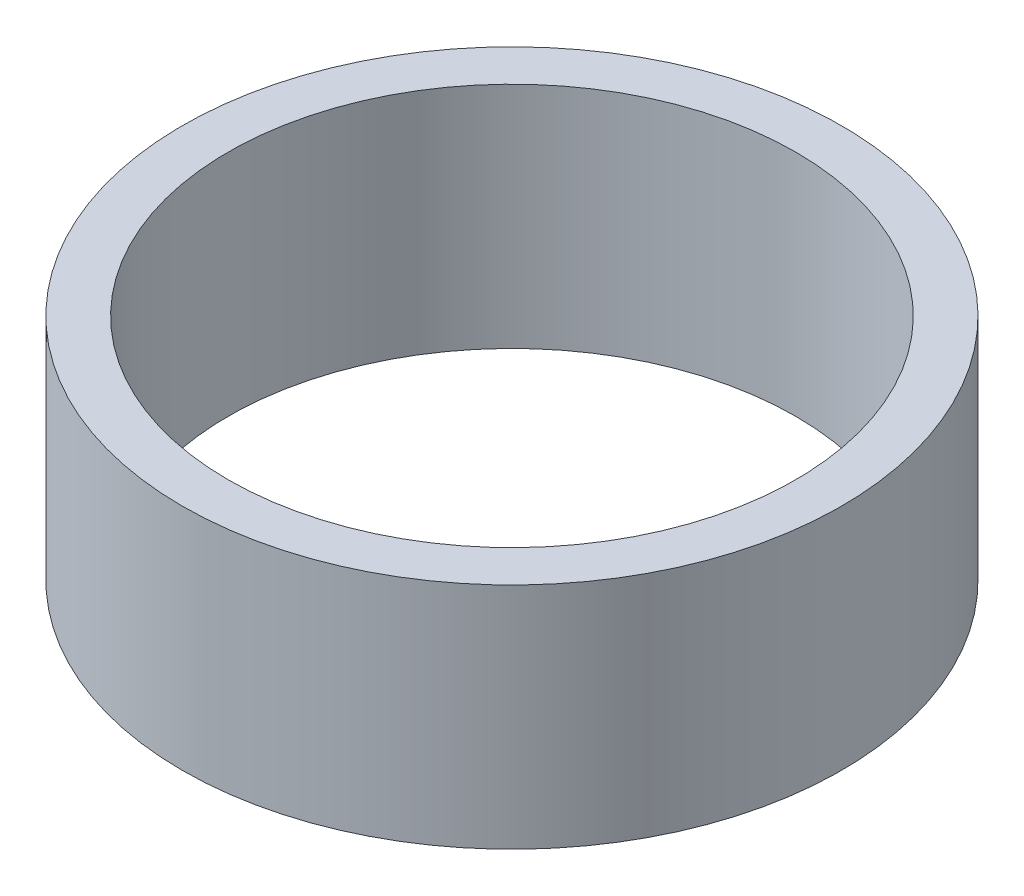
ISO-10303-21;
HEADER;
FILE_DESCRIPTION(('STEP AP214'),'2;1');
FILE_NAME('part.step','',(''),(''),'','','');
FILE_SCHEMA(('AUTOMOTIVE_DESIGN { 1 0 10303 214 1 1 1 1 }'));
ENDSEC;
DATA;
#1=APPLICATION_CONTEXT('core data for automotive mechanical design processes');
#2=APPLICATION_PROTOCOL_DEFINITION('international standard','automotive_design',2000,#1);
#3=PRODUCT_CONTEXT('',#1,'mechanical');
#4=PRODUCT('Part','Part','',(#3));
#5=PRODUCT_RELATED_PRODUCT_CATEGORY('part','',(#4));
#6=PRODUCT_DEFINITION_FORMATION('','',#4);
#7=PRODUCT_DEFINITION_CONTEXT('part definition',#1,'design');
#8=PRODUCT_DEFINITION('design','',#6,#7);
#9=PRODUCT_DEFINITION_SHAPE('','',#8);
#10=(LENGTH_UNIT() NAMED_UNIT(*) SI_UNIT(.MILLI.,.METRE.));
#11=(NAMED_UNIT(*) PLANE_ANGLE_UNIT() SI_UNIT($,.RADIAN.));
#12=(NAMED_UNIT(*) SI_UNIT($,.STERADIAN.) SOLID_ANGLE_UNIT());
#13=UNCERTAINTY_MEASURE_WITH_UNIT(LENGTH_MEASURE(1.E-05),#10,'distance_accuracy_value','');
#14=(GEOMETRIC_REPRESENTATION_CONTEXT(3) GLOBAL_UNCERTAINTY_ASSIGNED_CONTEXT((#13)) GLOBAL_UNIT_ASSIGNED_CONTEXT((#10,
#11,#12)) REPRESENTATION_CONTEXT('',''));
#15=CARTESIAN_POINT('',(0.,0.,0.));
#16=DIRECTION('',(0.,0.,1.));
#17=DIRECTION('',(1.,0.,0.));
#18=AXIS2_PLACEMENT_3D('',#15,#16,#17);
#19=CARTESIAN_POINT('',(0.,25.,0.));
#20=DIRECTION('',(0.,1.,0.));
#21=DIRECTION('',(0.,0.,1.));
#22=AXIS2_PLACEMENT_3D('',#19,#20,#21);
#23=PLANE('',#22);
#24=CARTESIAN_POINT('',(0.,25.,0.));
#25=DIRECTION('',(0.,1.,0.));
#26=DIRECTION('',(0.,0.,1.));
#27=AXIS2_PLACEMENT_3D('',#24,#25,#26);
#28=CIRCLE('',#27,36.);
#29=CARTESIAN_POINT('',(0.,25.,36.));
#30=VERTEX_POINT('',#29);
#31=EDGE_CURVE('E10',#30,#30,#28,.T.);
#32=ORIENTED_EDGE('',*,*,#31,.T.);
#33=EDGE_LOOP('',(#32));
#34=FACE_BOUND('',#33,.T.);
#35=CARTESIAN_POINT('',(0.,25.,0.));
#36=DIRECTION('',(0.,1.,0.));
#37=DIRECTION('',(0.,0.,1.));
#38=AXIS2_PLACEMENT_3D('',#35,#36,#37);
#39=CIRCLE('',#38,31.);
#40=CARTESIAN_POINT('',(0.,25.,31.));
#41=VERTEX_POINT('',#40);
#42=EDGE_CURVE('E43',#41,#41,#39,.T.);
#43=ORIENTED_EDGE('',*,*,#42,.F.);
#44=EDGE_LOOP('',(#43));
#45=FACE_BOUND('',#44,.T.);
#46=ADVANCED_FACE('F32',(#34,#45),#23,.T.);
#47=CARTESIAN_POINT('',(0.,0.,0.));
#48=DIRECTION('',(0.,1.,0.));
#49=DIRECTION('',(0.,0.,1.));
#50=AXIS2_PLACEMENT_3D('',#47,#48,#49);
#51=PLANE('',#50);
#52=CARTESIAN_POINT('',(0.,0.,0.));
#53=DIRECTION('',(0.,1.,0.));
#54=DIRECTION('',(0.,0.,1.));
#55=AXIS2_PLACEMENT_3D('',#52,#53,#54);
#56=CIRCLE('',#55,36.);
#57=CARTESIAN_POINT('',(0.,0.,36.));
#58=VERTEX_POINT('',#57);
#59=EDGE_CURVE('E36',#58,#58,#56,.T.);
#60=ORIENTED_EDGE('',*,*,#59,.F.);
#61=EDGE_LOOP('',(#60));
#62=FACE_BOUND('',#61,.T.);
#63=CARTESIAN_POINT('',(0.,0.,0.));
#64=DIRECTION('',(0.,1.,0.));
#65=DIRECTION('',(0.,0.,1.));
#66=AXIS2_PLACEMENT_3D('',#63,#64,#65);
#67=CIRCLE('',#66,31.);
#68=CARTESIAN_POINT('',(0.,0.,31.));
#69=VERTEX_POINT('',#68);
#70=EDGE_CURVE('E45',#69,#69,#67,.T.);
#71=ORIENTED_EDGE('',*,*,#70,.T.);
#72=EDGE_LOOP('',(#71));
#73=FACE_BOUND('',#72,.T.);
#74=ADVANCED_FACE('F55',(#62,#73),#51,.F.);
#75=CARTESIAN_POINT('',(0.,25.,0.));
#76=DIRECTION('',(0.,-1.,0.));
#77=DIRECTION('',(0.,0.,-1.));
#78=AXIS2_PLACEMENT_3D('',#75,#76,#77);
#79=CYLINDRICAL_SURFACE('',#78,36.);
#80=ORIENTED_EDGE('',*,*,#31,.F.);
#81=EDGE_LOOP('',(#80));
#82=FACE_BOUND('',#81,.T.);
#83=ORIENTED_EDGE('',*,*,#59,.T.);
#84=EDGE_LOOP('',(#83));
#85=FACE_BOUND('',#84,.T.);
#86=ADVANCED_FACE('F34',(#82,#85),#79,.T.);
#87=CARTESIAN_POINT('',(0.,25.,0.));
#88=DIRECTION('',(0.,-1.,0.));
#89=DIRECTION('',(0.,0.,-1.));
#90=AXIS2_PLACEMENT_3D('',#87,#88,#89);
#91=CYLINDRICAL_SURFACE('',#90,31.);
#92=ORIENTED_EDGE('',*,*,#42,.T.);
#93=EDGE_LOOP('',(#92));
#94=FACE_BOUND('',#93,.T.);
#95=ORIENTED_EDGE('',*,*,#70,.F.);
#96=EDGE_LOOP('',(#95));
#97=FACE_BOUND('',#96,.T.);
#98=ADVANCED_FACE('F51',(#94,#97),#91,.F.);
#99=CLOSED_SHELL('',(#46,#74,#86,#98));
#100=MANIFOLD_SOLID_BREP('B2',#99);
#101=ADVANCED_BREP_SHAPE_REPRESENTATION('',(#18,#100),#14);
#102=SHAPE_DEFINITION_REPRESENTATION(#9,#101);
ENDSEC;
END-ISO-10303-21;
